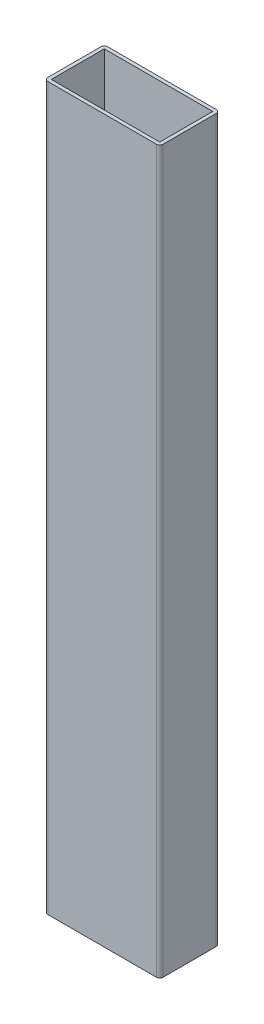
ISO-10303-21;
HEADER;
FILE_DESCRIPTION(('STEP AP214'),'2;1');
FILE_NAME('part.step','',(''),(''),'','','');
FILE_SCHEMA(('AUTOMOTIVE_DESIGN { 1 0 10303 214 1 1 1 1 }'));
ENDSEC;
DATA;
#1=APPLICATION_CONTEXT('core data for automotive mechanical design processes');
#2=APPLICATION_PROTOCOL_DEFINITION('international standard','automotive_design',2000,#1);
#3=PRODUCT_CONTEXT('',#1,'mechanical');
#4=PRODUCT('Part','Part','',(#3));
#5=PRODUCT_RELATED_PRODUCT_CATEGORY('part','',(#4));
#6=PRODUCT_DEFINITION_FORMATION('','',#4);
#7=PRODUCT_DEFINITION_CONTEXT('part definition',#1,'design');
#8=PRODUCT_DEFINITION('design','',#6,#7);
#9=PRODUCT_DEFINITION_SHAPE('','',#8);
#10=(LENGTH_UNIT() NAMED_UNIT(*) SI_UNIT(.MILLI.,.METRE.));
#11=(NAMED_UNIT(*) PLANE_ANGLE_UNIT() SI_UNIT($,.RADIAN.));
#12=(NAMED_UNIT(*) SI_UNIT($,.STERADIAN.) SOLID_ANGLE_UNIT());
#13=UNCERTAINTY_MEASURE_WITH_UNIT(LENGTH_MEASURE(1.E-05),#10,'distance_accuracy_value','');
#14=(GEOMETRIC_REPRESENTATION_CONTEXT(3) GLOBAL_UNCERTAINTY_ASSIGNED_CONTEXT((#13)) GLOBAL_UNIT_ASSIGNED_CONTEXT((#10,
#11,#12)) REPRESENTATION_CONTEXT('',''));
#15=CARTESIAN_POINT('',(0.,0.,0.));
#16=DIRECTION('',(0.,0.,1.));
#17=DIRECTION('',(1.,0.,0.));
#18=AXIS2_PLACEMENT_3D('',#15,#16,#17);
#19=CARTESIAN_POINT('',(-24.8285,165.1,12.1285));
#20=DIRECTION('',(0.,1.,0.));
#21=DIRECTION('',(0.,0.,1.));
#22=AXIS2_PLACEMENT_3D('',#19,#20,#21);
#23=PLANE('',#22);
#24=CARTESIAN_POINT('',(-24.8285,165.1,12.1285));
#25=DIRECTION('',(0.,1.,0.));
#26=DIRECTION('',(0.,0.,-1.));
#27=AXIS2_PLACEMENT_3D('',#24,#25,#26);
#28=CIRCLE('',#27,1.5875);
#29=CARTESIAN_POINT('',(-26.416,165.1,12.1285));
#30=VERTEX_POINT('',#29);
#31=CARTESIAN_POINT('',(-24.8285,165.1,13.716));
#32=VERTEX_POINT('',#31);
#33=EDGE_CURVE('E202',#30,#32,#28,.T.);
#34=ORIENTED_EDGE('',*,*,#33,.T.);
#35=DIRECTION('',(1.,0.,0.));
#36=VECTOR('',#35,1.);
#37=CARTESIAN_POINT('',(-24.8285,165.1,13.716));
#38=LINE('',#37,#36);
#39=CARTESIAN_POINT('',(24.8285,165.1,13.716));
#40=VERTEX_POINT('',#39);
#41=EDGE_CURVE('E205',#32,#40,#38,.T.);
#42=ORIENTED_EDGE('',*,*,#41,.T.);
#43=CARTESIAN_POINT('',(24.8285,165.1,12.1285));
#44=DIRECTION('',(0.,1.,0.));
#45=DIRECTION('',(0.,0.,1.));
#46=AXIS2_PLACEMENT_3D('',#43,#44,#45);
#47=CIRCLE('',#46,1.5875);
#48=CARTESIAN_POINT('',(26.416,165.1,12.1285));
#49=VERTEX_POINT('',#48);
#50=EDGE_CURVE('E208',#40,#49,#47,.T.);
#51=ORIENTED_EDGE('',*,*,#50,.T.);
#52=DIRECTION('',(0.,0.,-1.));
#53=VECTOR('',#52,1.);
#54=CARTESIAN_POINT('',(26.416,165.1,12.1285));
#55=LINE('',#54,#53);
#56=CARTESIAN_POINT('',(26.416,165.1,-12.1285));
#57=VERTEX_POINT('',#56);
#58=EDGE_CURVE('E210',#49,#57,#55,.T.);
#59=ORIENTED_EDGE('',*,*,#58,.T.);
#60=CARTESIAN_POINT('',(24.8285,165.1,-12.1285));
#61=DIRECTION('',(0.,1.,0.));
#62=DIRECTION('',(0.,0.,-1.));
#63=AXIS2_PLACEMENT_3D('',#60,#61,#62);
#64=CIRCLE('',#63,1.5875);
#65=CARTESIAN_POINT('',(24.8285,165.1,-13.716));
#66=VERTEX_POINT('',#65);
#67=EDGE_CURVE('E212',#57,#66,#64,.T.);
#68=ORIENTED_EDGE('',*,*,#67,.T.);
#69=DIRECTION('',(-1.,0.,0.));
#70=VECTOR('',#69,1.);
#71=CARTESIAN_POINT('',(-24.8285,165.1,-13.716));
#72=LINE('',#71,#70);
#73=CARTESIAN_POINT('',(-24.8285,165.1,-13.716));
#74=VERTEX_POINT('',#73);
#75=EDGE_CURVE('E214',#66,#74,#72,.T.);
#76=ORIENTED_EDGE('',*,*,#75,.T.);
#77=CARTESIAN_POINT('',(-24.8285,165.1,-12.1285));
#78=DIRECTION('',(0.,1.,0.));
#79=DIRECTION('',(0.,0.,-1.));
#80=AXIS2_PLACEMENT_3D('',#77,#78,#79);
#81=CIRCLE('',#80,1.5875);
#82=CARTESIAN_POINT('',(-26.416,165.1,-12.1285));
#83=VERTEX_POINT('',#82);
#84=EDGE_CURVE('E216',#74,#83,#81,.T.);
#85=ORIENTED_EDGE('',*,*,#84,.T.);
#86=DIRECTION('',(0.,0.,1.));
#87=VECTOR('',#86,1.);
#88=CARTESIAN_POINT('',(-26.416,165.1,12.1285));
#89=LINE('',#88,#87);
#90=EDGE_CURVE('E218',#83,#30,#89,.T.);
#91=ORIENTED_EDGE('',*,*,#90,.T.);
#92=EDGE_LOOP('',(#34,#42,#51,#59,#68,#76,#85,#91));
#93=FACE_BOUND('',#92,.T.);
#94=DIRECTION('',(1.,0.,0.));
#95=VECTOR('',#94,1.);
#96=CARTESIAN_POINT('',(-24.8285,165.1,12.1285));
#97=LINE('',#96,#95);
#98=CARTESIAN_POINT('',(-24.8285,165.1,12.1285));
#99=VERTEX_POINT('',#98);
#100=CARTESIAN_POINT('',(24.8285,165.1,12.1285));
#101=VERTEX_POINT('',#100);
#102=EDGE_CURVE('E174',#99,#101,#97,.T.);
#103=ORIENTED_EDGE('',*,*,#102,.F.);
#104=DIRECTION('',(0.,0.,1.));
#105=VECTOR('',#104,1.);
#106=CARTESIAN_POINT('',(-24.8285,165.1,12.1285));
#107=LINE('',#106,#105);
#108=CARTESIAN_POINT('',(-24.8285,165.1,-12.1285));
#109=VERTEX_POINT('',#108);
#110=EDGE_CURVE('E166',#109,#99,#107,.T.);
#111=ORIENTED_EDGE('',*,*,#110,.F.);
#112=DIRECTION('',(-1.,0.,0.));
#113=VECTOR('',#112,1.);
#114=CARTESIAN_POINT('',(-24.8285,165.1,-12.1285));
#115=LINE('',#114,#113);
#116=CARTESIAN_POINT('',(24.8285,165.1,-12.1285));
#117=VERTEX_POINT('',#116);
#118=EDGE_CURVE('E188',#117,#109,#115,.T.);
#119=ORIENTED_EDGE('',*,*,#118,.F.);
#120=DIRECTION('',(0.,0.,-1.));
#121=VECTOR('',#120,1.);
#122=CARTESIAN_POINT('',(24.8285,165.1,12.1285));
#123=LINE('',#122,#121);
#124=EDGE_CURVE('E186',#101,#117,#123,.T.);
#125=ORIENTED_EDGE('',*,*,#124,.F.);
#126=EDGE_LOOP('',(#103,#111,#119,#125));
#127=FACE_BOUND('',#126,.T.);
#128=ADVANCED_FACE('F77',(#93,#127),#23,.T.);
#129=CARTESIAN_POINT('',(-24.8285,-165.1,12.1285));
#130=DIRECTION('',(0.,1.,0.));
#131=DIRECTION('',(0.,0.,1.));
#132=AXIS2_PLACEMENT_3D('',#129,#130,#131);
#133=PLANE('',#132);
#134=CARTESIAN_POINT('',(-24.8285,-165.1,12.1285));
#135=DIRECTION('',(0.,1.,0.));
#136=DIRECTION('',(0.,0.,-1.));
#137=AXIS2_PLACEMENT_3D('',#134,#135,#136);
#138=CIRCLE('',#137,1.5875);
#139=CARTESIAN_POINT('',(-26.416,-165.1,12.1285));
#140=VERTEX_POINT('',#139);
#141=CARTESIAN_POINT('',(-24.8285,-165.1,13.716));
#142=VERTEX_POINT('',#141);
#143=EDGE_CURVE('E182',#140,#142,#138,.T.);
#144=ORIENTED_EDGE('',*,*,#143,.F.);
#145=DIRECTION('',(0.,0.,1.));
#146=VECTOR('',#145,1.);
#147=CARTESIAN_POINT('',(-26.416,-165.1,12.1285));
#148=LINE('',#147,#146);
#149=CARTESIAN_POINT('',(-26.416,-165.1,-12.1285));
#150=VERTEX_POINT('',#149);
#151=EDGE_CURVE('E206',#150,#140,#148,.T.);
#152=ORIENTED_EDGE('',*,*,#151,.F.);
#153=CARTESIAN_POINT('',(-24.8285,-165.1,-12.1285));
#154=DIRECTION('',(0.,1.,0.));
#155=DIRECTION('',(0.,0.,-1.));
#156=AXIS2_PLACEMENT_3D('',#153,#154,#155);
#157=CIRCLE('',#156,1.5875);
#158=CARTESIAN_POINT('',(-24.8285,-165.1,-13.716));
#159=VERTEX_POINT('',#158);
#160=EDGE_CURVE('E233',#159,#150,#157,.T.);
#161=ORIENTED_EDGE('',*,*,#160,.F.);
#162=DIRECTION('',(-1.,0.,0.));
#163=VECTOR('',#162,1.);
#164=CARTESIAN_POINT('',(-24.8285,-165.1,-13.716));
#165=LINE('',#164,#163);
#166=CARTESIAN_POINT('',(24.8285,-165.1,-13.716));
#167=VERTEX_POINT('',#166);
#168=EDGE_CURVE('E231',#167,#159,#165,.T.);
#169=ORIENTED_EDGE('',*,*,#168,.F.);
#170=CARTESIAN_POINT('',(24.8285,-165.1,-12.1285));
#171=DIRECTION('',(0.,1.,0.));
#172=DIRECTION('',(0.,0.,-1.));
#173=AXIS2_PLACEMENT_3D('',#170,#171,#172);
#174=CIRCLE('',#173,1.5875);
#175=CARTESIAN_POINT('',(26.416,-165.1,-12.1285));
#176=VERTEX_POINT('',#175);
#177=EDGE_CURVE('E229',#176,#167,#174,.T.);
#178=ORIENTED_EDGE('',*,*,#177,.F.);
#179=DIRECTION('',(0.,0.,-1.));
#180=VECTOR('',#179,1.);
#181=CARTESIAN_POINT('',(26.416,-165.1,12.1285));
#182=LINE('',#181,#180);
#183=CARTESIAN_POINT('',(26.416,-165.1,12.1285));
#184=VERTEX_POINT('',#183);
#185=EDGE_CURVE('E227',#184,#176,#182,.T.);
#186=ORIENTED_EDGE('',*,*,#185,.F.);
#187=CARTESIAN_POINT('',(24.8285,-165.1,12.1285));
#188=DIRECTION('',(0.,1.,0.));
#189=DIRECTION('',(0.,0.,1.));
#190=AXIS2_PLACEMENT_3D('',#187,#188,#189);
#191=CIRCLE('',#190,1.5875);
#192=CARTESIAN_POINT('',(24.8285,-165.1,13.716));
#193=VERTEX_POINT('',#192);
#194=EDGE_CURVE('E225',#193,#184,#191,.T.);
#195=ORIENTED_EDGE('',*,*,#194,.F.);
#196=DIRECTION('',(1.,0.,0.));
#197=VECTOR('',#196,1.);
#198=CARTESIAN_POINT('',(-24.8285,-165.1,13.716));
#199=LINE('',#198,#197);
#200=EDGE_CURVE('E223',#142,#193,#199,.T.);
#201=ORIENTED_EDGE('',*,*,#200,.F.);
#202=EDGE_LOOP('',(#144,#152,#161,#169,#178,#186,#195,#201));
#203=FACE_BOUND('',#202,.T.);
#204=DIRECTION('',(0.,0.,1.));
#205=VECTOR('',#204,1.);
#206=CARTESIAN_POINT('',(-24.8285,-165.1,12.1285));
#207=LINE('',#206,#205);
#208=CARTESIAN_POINT('',(-24.8285,-165.1,-12.1285));
#209=VERTEX_POINT('',#208);
#210=CARTESIAN_POINT('',(-24.8285,-165.1,12.1285));
#211=VERTEX_POINT('',#210);
#212=EDGE_CURVE('E100',#209,#211,#207,.T.);
#213=ORIENTED_EDGE('',*,*,#212,.T.);
#214=DIRECTION('',(1.,0.,0.));
#215=VECTOR('',#214,1.);
#216=CARTESIAN_POINT('',(-24.8285,-165.1,12.1285));
#217=LINE('',#216,#215);
#218=CARTESIAN_POINT('',(24.8285,-165.1,12.1285));
#219=VERTEX_POINT('',#218);
#220=EDGE_CURVE('E181',#211,#219,#217,.T.);
#221=ORIENTED_EDGE('',*,*,#220,.T.);
#222=DIRECTION('',(0.,0.,-1.));
#223=VECTOR('',#222,1.);
#224=CARTESIAN_POINT('',(24.8285,-165.1,12.1285));
#225=LINE('',#224,#223);
#226=CARTESIAN_POINT('',(24.8285,-165.1,-12.1285));
#227=VERTEX_POINT('',#226);
#228=EDGE_CURVE('E194',#219,#227,#225,.T.);
#229=ORIENTED_EDGE('',*,*,#228,.T.);
#230=DIRECTION('',(-1.,0.,0.));
#231=VECTOR('',#230,1.);
#232=CARTESIAN_POINT('',(-24.8285,-165.1,-12.1285));
#233=LINE('',#232,#231);
#234=EDGE_CURVE('E175',#227,#209,#233,.T.);
#235=ORIENTED_EDGE('',*,*,#234,.T.);
#236=EDGE_LOOP('',(#213,#221,#229,#235));
#237=FACE_BOUND('',#236,.T.);
#238=ADVANCED_FACE('F263',(#203,#237),#133,.F.);
#239=CARTESIAN_POINT('',(-24.8285,165.1,12.1285));
#240=DIRECTION('',(0.,-1.,0.));
#241=DIRECTION('',(0.,0.,-1.));
#242=AXIS2_PLACEMENT_3D('',#239,#240,#241);
#243=CYLINDRICAL_SURFACE('',#242,1.5875);
#244=ORIENTED_EDGE('',*,*,#143,.T.);
#245=DIRECTION('',(0.,-1.,0.));
#246=VECTOR('',#245,1.);
#247=CARTESIAN_POINT('',(-24.8285,165.1,13.716));
#248=LINE('',#247,#246);
#249=EDGE_CURVE('E12',#32,#142,#248,.T.);
#250=ORIENTED_EDGE('',*,*,#249,.F.);
#251=ORIENTED_EDGE('',*,*,#33,.F.);
#252=DIRECTION('',(0.,-1.,0.));
#253=VECTOR('',#252,1.);
#254=CARTESIAN_POINT('',(-26.416,165.1,12.1285));
#255=LINE('',#254,#253);
#256=EDGE_CURVE('E220',#30,#140,#255,.T.);
#257=ORIENTED_EDGE('',*,*,#256,.T.);
#258=EDGE_LOOP('',(#244,#250,#251,#257));
#259=FACE_BOUND('',#258,.T.);
#260=ADVANCED_FACE('F79',(#259),#243,.T.);
#261=CARTESIAN_POINT('',(-24.8285,165.1,13.716));
#262=DIRECTION('',(0.,0.,-1.));
#263=DIRECTION('',(-1.,0.,0.));
#264=AXIS2_PLACEMENT_3D('',#261,#262,#263);
#265=PLANE('',#264);
#266=ORIENTED_EDGE('',*,*,#200,.T.);
#267=DIRECTION('',(0.,-1.,0.));
#268=VECTOR('',#267,1.);
#269=CARTESIAN_POINT('',(24.8285,165.1,13.716));
#270=LINE('',#269,#268);
#271=EDGE_CURVE('E85',#40,#193,#270,.T.);
#272=ORIENTED_EDGE('',*,*,#271,.F.);
#273=ORIENTED_EDGE('',*,*,#41,.F.);
#274=ORIENTED_EDGE('',*,*,#249,.T.);
#275=EDGE_LOOP('',(#266,#272,#273,#274));
#276=FACE_BOUND('',#275,.T.);
#277=ADVANCED_FACE('F280',(#276),#265,.F.);
#278=CARTESIAN_POINT('',(24.8285,165.1,12.1285));
#279=DIRECTION('',(0.,-1.,0.));
#280=DIRECTION('',(0.,0.,-1.));
#281=AXIS2_PLACEMENT_3D('',#278,#279,#280);
#282=CYLINDRICAL_SURFACE('',#281,1.5875);
#283=ORIENTED_EDGE('',*,*,#194,.T.);
#284=DIRECTION('',(0.,-1.,0.));
#285=VECTOR('',#284,1.);
#286=CARTESIAN_POINT('',(26.416,165.1,12.1285));
#287=LINE('',#286,#285);
#288=EDGE_CURVE('E250',#49,#184,#287,.T.);
#289=ORIENTED_EDGE('',*,*,#288,.F.);
#290=ORIENTED_EDGE('',*,*,#50,.F.);
#291=ORIENTED_EDGE('',*,*,#271,.T.);
#292=EDGE_LOOP('',(#283,#289,#290,#291));
#293=FACE_BOUND('',#292,.T.);
#294=ADVANCED_FACE('F257',(#293),#282,.T.);
#295=CARTESIAN_POINT('',(26.416,165.1,12.1285));
#296=DIRECTION('',(-1.,0.,0.));
#297=DIRECTION('',(0.,0.,1.));
#298=AXIS2_PLACEMENT_3D('',#295,#296,#297);
#299=PLANE('',#298);
#300=ORIENTED_EDGE('',*,*,#185,.T.);
#301=DIRECTION('',(0.,-1.,0.));
#302=VECTOR('',#301,1.);
#303=CARTESIAN_POINT('',(26.416,165.1,-12.1285));
#304=LINE('',#303,#302);
#305=EDGE_CURVE('E247',#57,#176,#304,.T.);
#306=ORIENTED_EDGE('',*,*,#305,.F.);
#307=ORIENTED_EDGE('',*,*,#58,.F.);
#308=ORIENTED_EDGE('',*,*,#288,.T.);
#309=EDGE_LOOP('',(#300,#306,#307,#308));
#310=FACE_BOUND('',#309,.T.);
#311=ADVANCED_FACE('F269',(#310),#299,.F.);
#312=CARTESIAN_POINT('',(24.8285,165.1,-12.1285));
#313=DIRECTION('',(0.,-1.,0.));
#314=DIRECTION('',(0.,0.,-1.));
#315=AXIS2_PLACEMENT_3D('',#312,#313,#314);
#316=CYLINDRICAL_SURFACE('',#315,1.5875);
#317=ORIENTED_EDGE('',*,*,#177,.T.);
#318=DIRECTION('',(0.,-1.,0.));
#319=VECTOR('',#318,1.);
#320=CARTESIAN_POINT('',(24.8285,165.1,-13.716));
#321=LINE('',#320,#319);
#322=EDGE_CURVE('E244',#66,#167,#321,.T.);
#323=ORIENTED_EDGE('',*,*,#322,.F.);
#324=ORIENTED_EDGE('',*,*,#67,.F.);
#325=ORIENTED_EDGE('',*,*,#305,.T.);
#326=EDGE_LOOP('',(#317,#323,#324,#325));
#327=FACE_BOUND('',#326,.T.);
#328=ADVANCED_FACE('F273',(#327),#316,.T.);
#329=CARTESIAN_POINT('',(-24.8285,165.1,-13.716));
#330=DIRECTION('',(0.,0.,1.));
#331=DIRECTION('',(1.,0.,0.));
#332=AXIS2_PLACEMENT_3D('',#329,#330,#331);
#333=PLANE('',#332);
#334=ORIENTED_EDGE('',*,*,#168,.T.);
#335=DIRECTION('',(0.,-1.,0.));
#336=VECTOR('',#335,1.);
#337=CARTESIAN_POINT('',(-24.8285,165.1,-13.716));
#338=LINE('',#337,#336);
#339=EDGE_CURVE('E241',#74,#159,#338,.T.);
#340=ORIENTED_EDGE('',*,*,#339,.F.);
#341=ORIENTED_EDGE('',*,*,#75,.F.);
#342=ORIENTED_EDGE('',*,*,#322,.T.);
#343=EDGE_LOOP('',(#334,#340,#341,#342));
#344=FACE_BOUND('',#343,.T.);
#345=ADVANCED_FACE('F293',(#344),#333,.F.);
#346=CARTESIAN_POINT('',(-24.8285,165.1,-12.1285));
#347=DIRECTION('',(0.,-1.,0.));
#348=DIRECTION('',(0.,0.,-1.));
#349=AXIS2_PLACEMENT_3D('',#346,#347,#348);
#350=CYLINDRICAL_SURFACE('',#349,1.5875);
#351=ORIENTED_EDGE('',*,*,#160,.T.);
#352=DIRECTION('',(0.,-1.,0.));
#353=VECTOR('',#352,1.);
#354=CARTESIAN_POINT('',(-26.416,165.1,-12.1285));
#355=LINE('',#354,#353);
#356=EDGE_CURVE('E238',#83,#150,#355,.T.);
#357=ORIENTED_EDGE('',*,*,#356,.F.);
#358=ORIENTED_EDGE('',*,*,#84,.F.);
#359=ORIENTED_EDGE('',*,*,#339,.T.);
#360=EDGE_LOOP('',(#351,#357,#358,#359));
#361=FACE_BOUND('',#360,.T.);
#362=ADVANCED_FACE('F291',(#361),#350,.T.);
#363=CARTESIAN_POINT('',(-26.416,165.1,12.1285));
#364=DIRECTION('',(1.,0.,0.));
#365=DIRECTION('',(0.,0.,-1.));
#366=AXIS2_PLACEMENT_3D('',#363,#364,#365);
#367=PLANE('',#366);
#368=ORIENTED_EDGE('',*,*,#151,.T.);
#369=ORIENTED_EDGE('',*,*,#256,.F.);
#370=ORIENTED_EDGE('',*,*,#90,.F.);
#371=ORIENTED_EDGE('',*,*,#356,.T.);
#372=EDGE_LOOP('',(#368,#369,#370,#371));
#373=FACE_BOUND('',#372,.T.);
#374=ADVANCED_FACE('F286',(#373),#367,.F.);
#375=CARTESIAN_POINT('',(-24.8285,165.1,12.1285));
#376=DIRECTION('',(1.,0.,0.));
#377=DIRECTION('',(0.,0.,-1.));
#378=AXIS2_PLACEMENT_3D('',#375,#376,#377);
#379=PLANE('',#378);
#380=ORIENTED_EDGE('',*,*,#212,.F.);
#381=DIRECTION('',(0.,-1.,0.));
#382=VECTOR('',#381,1.);
#383=CARTESIAN_POINT('',(-24.8285,165.1,-12.1285));
#384=LINE('',#383,#382);
#385=EDGE_CURVE('E170',#109,#209,#384,.T.);
#386=ORIENTED_EDGE('',*,*,#385,.F.);
#387=ORIENTED_EDGE('',*,*,#110,.T.);
#388=DIRECTION('',(0.,-1.,0.));
#389=VECTOR('',#388,1.);
#390=CARTESIAN_POINT('',(-24.8285,165.1,12.1285));
#391=LINE('',#390,#389);
#392=EDGE_CURVE('E169',#99,#211,#391,.T.);
#393=ORIENTED_EDGE('',*,*,#392,.T.);
#394=EDGE_LOOP('',(#380,#386,#387,#393));
#395=FACE_BOUND('',#394,.T.);
#396=ADVANCED_FACE('F168',(#395),#379,.T.);
#397=CARTESIAN_POINT('',(-24.8285,165.1,12.1285));
#398=DIRECTION('',(0.,0.,-1.));
#399=DIRECTION('',(-1.,0.,0.));
#400=AXIS2_PLACEMENT_3D('',#397,#398,#399);
#401=PLANE('',#400);
#402=ORIENTED_EDGE('',*,*,#220,.F.);
#403=ORIENTED_EDGE('',*,*,#392,.F.);
#404=ORIENTED_EDGE('',*,*,#102,.T.);
#405=DIRECTION('',(0.,-1.,0.));
#406=VECTOR('',#405,1.);
#407=CARTESIAN_POINT('',(24.8285,165.1,12.1285));
#408=LINE('',#407,#406);
#409=EDGE_CURVE('E183',#101,#219,#408,.T.);
#410=ORIENTED_EDGE('',*,*,#409,.T.);
#411=EDGE_LOOP('',(#402,#403,#404,#410));
#412=FACE_BOUND('',#411,.T.);
#413=ADVANCED_FACE('F178',(#412),#401,.T.);
#414=CARTESIAN_POINT('',(24.8285,165.1,12.1285));
#415=DIRECTION('',(-1.,0.,0.));
#416=DIRECTION('',(0.,0.,1.));
#417=AXIS2_PLACEMENT_3D('',#414,#415,#416);
#418=PLANE('',#417);
#419=ORIENTED_EDGE('',*,*,#228,.F.);
#420=ORIENTED_EDGE('',*,*,#409,.F.);
#421=ORIENTED_EDGE('',*,*,#124,.T.);
#422=DIRECTION('',(0.,-1.,0.));
#423=VECTOR('',#422,1.);
#424=CARTESIAN_POINT('',(24.8285,165.1,-12.1285));
#425=LINE('',#424,#423);
#426=EDGE_CURVE('E92',#117,#227,#425,.T.);
#427=ORIENTED_EDGE('',*,*,#426,.T.);
#428=EDGE_LOOP('',(#419,#420,#421,#427));
#429=FACE_BOUND('',#428,.T.);
#430=ADVANCED_FACE('F318',(#429),#418,.T.);
#431=CARTESIAN_POINT('',(-24.8285,165.1,-12.1285));
#432=DIRECTION('',(0.,0.,1.));
#433=DIRECTION('',(1.,0.,0.));
#434=AXIS2_PLACEMENT_3D('',#431,#432,#433);
#435=PLANE('',#434);
#436=ORIENTED_EDGE('',*,*,#234,.F.);
#437=ORIENTED_EDGE('',*,*,#426,.F.);
#438=ORIENTED_EDGE('',*,*,#118,.T.);
#439=ORIENTED_EDGE('',*,*,#385,.T.);
#440=EDGE_LOOP('',(#436,#437,#438,#439));
#441=FACE_BOUND('',#440,.T.);
#442=ADVANCED_FACE('F322',(#441),#435,.T.);
#443=CLOSED_SHELL('',(#128,#238,#260,#277,#294,#311,#328,#345,#362,#374,#396,#413,#430,#442));
#444=MANIFOLD_SOLID_BREP('B2',#443);
#445=ADVANCED_BREP_SHAPE_REPRESENTATION('',(#18,#444),#14);
#446=SHAPE_DEFINITION_REPRESENTATION(#9,#445);
ENDSEC;
END-ISO-10303-21;
